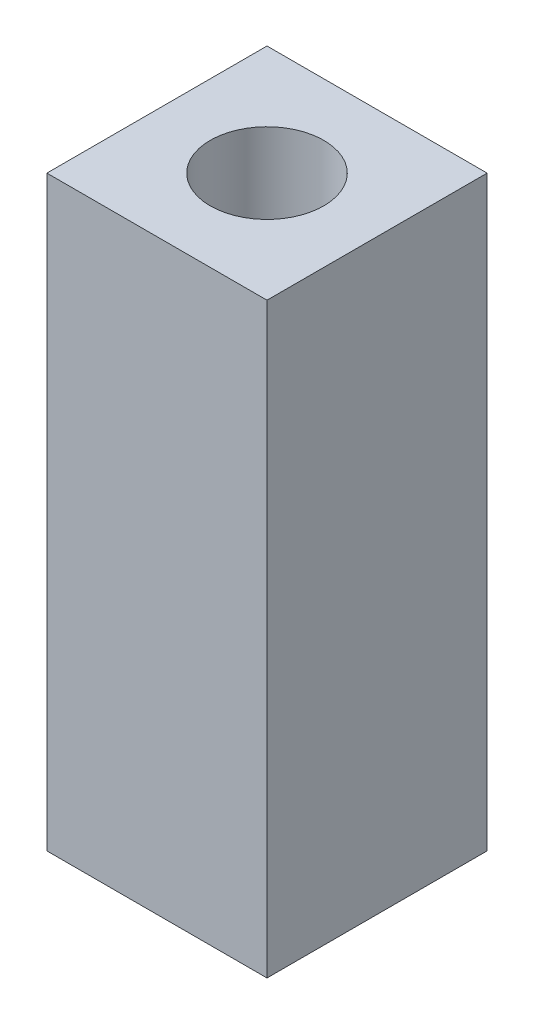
ISO-10303-21;
HEADER;
FILE_DESCRIPTION(('STEP AP214'),'2;1');
FILE_NAME('part.step','',(''),(''),'','','');
FILE_SCHEMA(('AUTOMOTIVE_DESIGN { 1 0 10303 214 1 1 1 1 }'));
ENDSEC;
DATA;
#1=APPLICATION_CONTEXT('core data for automotive mechanical design processes');
#2=APPLICATION_PROTOCOL_DEFINITION('international standard','automotive_design',2000,#1);
#3=PRODUCT_CONTEXT('',#1,'mechanical');
#4=PRODUCT('Part','Part','',(#3));
#5=PRODUCT_RELATED_PRODUCT_CATEGORY('part','',(#4));
#6=PRODUCT_DEFINITION_FORMATION('','',#4);
#7=PRODUCT_DEFINITION_CONTEXT('part definition',#1,'design');
#8=PRODUCT_DEFINITION('design','',#6,#7);
#9=PRODUCT_DEFINITION_SHAPE('','',#8);
#10=(LENGTH_UNIT() NAMED_UNIT(*) SI_UNIT(.MILLI.,.METRE.));
#11=(NAMED_UNIT(*) PLANE_ANGLE_UNIT() SI_UNIT($,.RADIAN.));
#12=(NAMED_UNIT(*) SI_UNIT($,.STERADIAN.) SOLID_ANGLE_UNIT());
#13=UNCERTAINTY_MEASURE_WITH_UNIT(LENGTH_MEASURE(1.E-05),#10,'distance_accuracy_value','');
#14=(GEOMETRIC_REPRESENTATION_CONTEXT(3) GLOBAL_UNCERTAINTY_ASSIGNED_CONTEXT((#13)) GLOBAL_UNIT_ASSIGNED_CONTEXT((#10,
#11,#12)) REPRESENTATION_CONTEXT('',''));
#15=CARTESIAN_POINT('',(0.,0.,0.));
#16=DIRECTION('',(0.,0.,1.));
#17=DIRECTION('',(1.,0.,0.));
#18=AXIS2_PLACEMENT_3D('',#15,#16,#17);
#19=CARTESIAN_POINT('',(4.7625,25.4,4.7625));
#20=DIRECTION('',(-1.,0.,0.));
#21=DIRECTION('',(0.,0.,1.));
#22=AXIS2_PLACEMENT_3D('',#19,#20,#21);
#23=PLANE('',#22);
#24=DIRECTION('',(0.,0.,-1.));
#25=VECTOR('',#24,1.);
#26=CARTESIAN_POINT('',(4.7625,0.,4.7625));
#27=LINE('',#26,#25);
#28=CARTESIAN_POINT('',(4.7625,0.,4.7625));
#29=VERTEX_POINT('',#28);
#30=CARTESIAN_POINT('',(4.7625,0.,-4.7625));
#31=VERTEX_POINT('',#30);
#32=EDGE_CURVE('E97',#29,#31,#27,.T.);
#33=ORIENTED_EDGE('',*,*,#32,.T.);
#34=DIRECTION('',(0.,-1.,0.));
#35=VECTOR('',#34,1.);
#36=CARTESIAN_POINT('',(4.7625,25.4,-4.7625));
#37=LINE('',#36,#35);
#38=CARTESIAN_POINT('',(4.7625,25.4,-4.7625));
#39=VERTEX_POINT('',#38);
#40=EDGE_CURVE('E11',#39,#31,#37,.T.);
#41=ORIENTED_EDGE('',*,*,#40,.F.);
#42=DIRECTION('',(0.,0.,-1.));
#43=VECTOR('',#42,1.);
#44=CARTESIAN_POINT('',(4.7625,25.4,4.7625));
#45=LINE('',#44,#43);
#46=CARTESIAN_POINT('',(4.7625,25.4,4.7625));
#47=VERTEX_POINT('',#46);
#48=EDGE_CURVE('E85',#47,#39,#45,.T.);
#49=ORIENTED_EDGE('',*,*,#48,.F.);
#50=DIRECTION('',(0.,-1.,0.));
#51=VECTOR('',#50,1.);
#52=CARTESIAN_POINT('',(4.7625,25.4,4.7625));
#53=LINE('',#52,#51);
#54=EDGE_CURVE('E93',#47,#29,#53,.T.);
#55=ORIENTED_EDGE('',*,*,#54,.T.);
#56=EDGE_LOOP('',(#33,#41,#49,#55));
#57=FACE_BOUND('',#56,.T.);
#58=ADVANCED_FACE('F34',(#57),#23,.F.);
#59=CARTESIAN_POINT('',(-4.7625,25.4,-4.7625));
#60=DIRECTION('',(0.,0.,1.));
#61=DIRECTION('',(1.,0.,0.));
#62=AXIS2_PLACEMENT_3D('',#59,#60,#61);
#63=PLANE('',#62);
#64=DIRECTION('',(-1.,0.,0.));
#65=VECTOR('',#64,1.);
#66=CARTESIAN_POINT('',(-4.7625,0.,-4.7625));
#67=LINE('',#66,#65);
#68=CARTESIAN_POINT('',(-4.7625,0.,-4.7625));
#69=VERTEX_POINT('',#68);
#70=EDGE_CURVE('E89',#31,#69,#67,.T.);
#71=ORIENTED_EDGE('',*,*,#70,.T.);
#72=DIRECTION('',(0.,-1.,0.));
#73=VECTOR('',#72,1.);
#74=CARTESIAN_POINT('',(-4.7625,25.4,-4.7625));
#75=LINE('',#74,#73);
#76=CARTESIAN_POINT('',(-4.7625,25.4,-4.7625));
#77=VERTEX_POINT('',#76);
#78=EDGE_CURVE('E42',#77,#69,#75,.T.);
#79=ORIENTED_EDGE('',*,*,#78,.F.);
#80=DIRECTION('',(-1.,0.,0.));
#81=VECTOR('',#80,1.);
#82=CARTESIAN_POINT('',(-4.7625,25.4,-4.7625));
#83=LINE('',#82,#81);
#84=EDGE_CURVE('E80',#39,#77,#83,.T.);
#85=ORIENTED_EDGE('',*,*,#84,.F.);
#86=ORIENTED_EDGE('',*,*,#40,.T.);
#87=EDGE_LOOP('',(#71,#79,#85,#86));
#88=FACE_BOUND('',#87,.T.);
#89=ADVANCED_FACE('F88',(#88),#63,.F.);
#90=CARTESIAN_POINT('',(-4.7625,25.4,4.7625));
#91=DIRECTION('',(1.,0.,0.));
#92=DIRECTION('',(0.,0.,-1.));
#93=AXIS2_PLACEMENT_3D('',#90,#91,#92);
#94=PLANE('',#93);
#95=DIRECTION('',(0.,0.,1.));
#96=VECTOR('',#95,1.);
#97=CARTESIAN_POINT('',(-4.7625,0.,4.7625));
#98=LINE('',#97,#96);
#99=CARTESIAN_POINT('',(-4.7625,0.,4.7625));
#100=VERTEX_POINT('',#99);
#101=EDGE_CURVE('E67',#69,#100,#98,.T.);
#102=ORIENTED_EDGE('',*,*,#101,.T.);
#103=DIRECTION('',(0.,-1.,0.));
#104=VECTOR('',#103,1.);
#105=CARTESIAN_POINT('',(-4.7625,25.4,4.7625));
#106=LINE('',#105,#104);
#107=CARTESIAN_POINT('',(-4.7625,25.4,4.7625));
#108=VERTEX_POINT('',#107);
#109=EDGE_CURVE('E90',#108,#100,#106,.T.);
#110=ORIENTED_EDGE('',*,*,#109,.F.);
#111=DIRECTION('',(0.,0.,1.));
#112=VECTOR('',#111,1.);
#113=CARTESIAN_POINT('',(-4.7625,25.4,4.7625));
#114=LINE('',#113,#112);
#115=EDGE_CURVE('E83',#77,#108,#114,.T.);
#116=ORIENTED_EDGE('',*,*,#115,.F.);
#117=ORIENTED_EDGE('',*,*,#78,.T.);
#118=EDGE_LOOP('',(#102,#110,#116,#117));
#119=FACE_BOUND('',#118,.T.);
#120=ADVANCED_FACE('F91',(#119),#94,.F.);
#121=CARTESIAN_POINT('',(-4.7625,25.4,4.7625));
#122=DIRECTION('',(0.,0.,-1.));
#123=DIRECTION('',(-1.,0.,0.));
#124=AXIS2_PLACEMENT_3D('',#121,#122,#123);
#125=PLANE('',#124);
#126=DIRECTION('',(1.,0.,0.));
#127=VECTOR('',#126,1.);
#128=CARTESIAN_POINT('',(-4.7625,0.,4.7625));
#129=LINE('',#128,#127);
#130=EDGE_CURVE('E73',#100,#29,#129,.T.);
#131=ORIENTED_EDGE('',*,*,#130,.T.);
#132=ORIENTED_EDGE('',*,*,#54,.F.);
#133=DIRECTION('',(1.,0.,0.));
#134=VECTOR('',#133,1.);
#135=CARTESIAN_POINT('',(-4.7625,25.4,4.7625));
#136=LINE('',#135,#134);
#137=EDGE_CURVE('E50',#108,#47,#136,.T.);
#138=ORIENTED_EDGE('',*,*,#137,.F.);
#139=ORIENTED_EDGE('',*,*,#109,.T.);
#140=EDGE_LOOP('',(#131,#132,#138,#139));
#141=FACE_BOUND('',#140,.T.);
#142=ADVANCED_FACE('F105',(#141),#125,.F.);
#143=CARTESIAN_POINT('',(0.,25.4,0.));
#144=DIRECTION('',(0.,-1.,0.));
#145=DIRECTION('',(0.,0.,-1.));
#146=AXIS2_PLACEMENT_3D('',#143,#144,#145);
#147=PLANE('',#146);
#148=CARTESIAN_POINT('',(0.,25.4,0.));
#149=DIRECTION('',(0.,1.,0.));
#150=DIRECTION('',(0.,0.,1.));
#151=AXIS2_PLACEMENT_3D('',#148,#149,#150);
#152=CIRCLE('',#151,2.45745);
#153=CARTESIAN_POINT('',(0.,25.4,2.45745));
#154=VERTEX_POINT('',#153);
#155=EDGE_CURVE('E113',#154,#154,#152,.T.);
#156=ORIENTED_EDGE('',*,*,#155,.F.);
#157=EDGE_LOOP('',(#156));
#158=FACE_BOUND('',#157,.T.);
#159=ORIENTED_EDGE('',*,*,#48,.T.);
#160=ORIENTED_EDGE('',*,*,#84,.T.);
#161=ORIENTED_EDGE('',*,*,#115,.T.);
#162=ORIENTED_EDGE('',*,*,#137,.T.);
#163=EDGE_LOOP('',(#159,#160,#161,#162));
#164=FACE_BOUND('',#163,.T.);
#165=ADVANCED_FACE('F81',(#158,#164),#147,.F.);
#166=CARTESIAN_POINT('',(0.,0.,0.));
#167=DIRECTION('',(0.,-1.,0.));
#168=DIRECTION('',(0.,0.,-1.));
#169=AXIS2_PLACEMENT_3D('',#166,#167,#168);
#170=PLANE('',#169);
#171=CARTESIAN_POINT('',(0.,0.,0.));
#172=DIRECTION('',(0.,1.,0.));
#173=DIRECTION('',(0.,0.,1.));
#174=AXIS2_PLACEMENT_3D('',#171,#172,#173);
#175=CIRCLE('',#174,2.45745);
#176=CARTESIAN_POINT('',(0.,0.,2.45745));
#177=VERTEX_POINT('',#176);
#178=EDGE_CURVE('E100',#177,#177,#175,.T.);
#179=ORIENTED_EDGE('',*,*,#178,.T.);
#180=EDGE_LOOP('',(#179));
#181=FACE_BOUND('',#180,.T.);
#182=ORIENTED_EDGE('',*,*,#32,.F.);
#183=ORIENTED_EDGE('',*,*,#130,.F.);
#184=ORIENTED_EDGE('',*,*,#101,.F.);
#185=ORIENTED_EDGE('',*,*,#70,.F.);
#186=EDGE_LOOP('',(#182,#183,#184,#185));
#187=FACE_BOUND('',#186,.T.);
#188=ADVANCED_FACE('F108',(#181,#187),#170,.T.);
#189=CARTESIAN_POINT('',(0.,25.4,0.));
#190=DIRECTION('',(0.,1.,0.));
#191=DIRECTION('',(0.,0.,1.));
#192=AXIS2_PLACEMENT_3D('',#189,#190,#191);
#193=CYLINDRICAL_SURFACE('',#192,2.45745);
#194=ORIENTED_EDGE('',*,*,#178,.F.);
#195=EDGE_LOOP('',(#194));
#196=FACE_BOUND('',#195,.T.);
#197=ORIENTED_EDGE('',*,*,#155,.T.);
#198=EDGE_LOOP('',(#197));
#199=FACE_BOUND('',#198,.T.);
#200=ADVANCED_FACE('F117',(#196,#199),#193,.F.);
#201=CLOSED_SHELL('',(#58,#89,#120,#142,#165,#188,#200));
#202=MANIFOLD_SOLID_BREP('B2',#201);
#203=ADVANCED_BREP_SHAPE_REPRESENTATION('',(#18,#202),#14);
#204=SHAPE_DEFINITION_REPRESENTATION(#9,#203);
ENDSEC;
END-ISO-10303-21;
